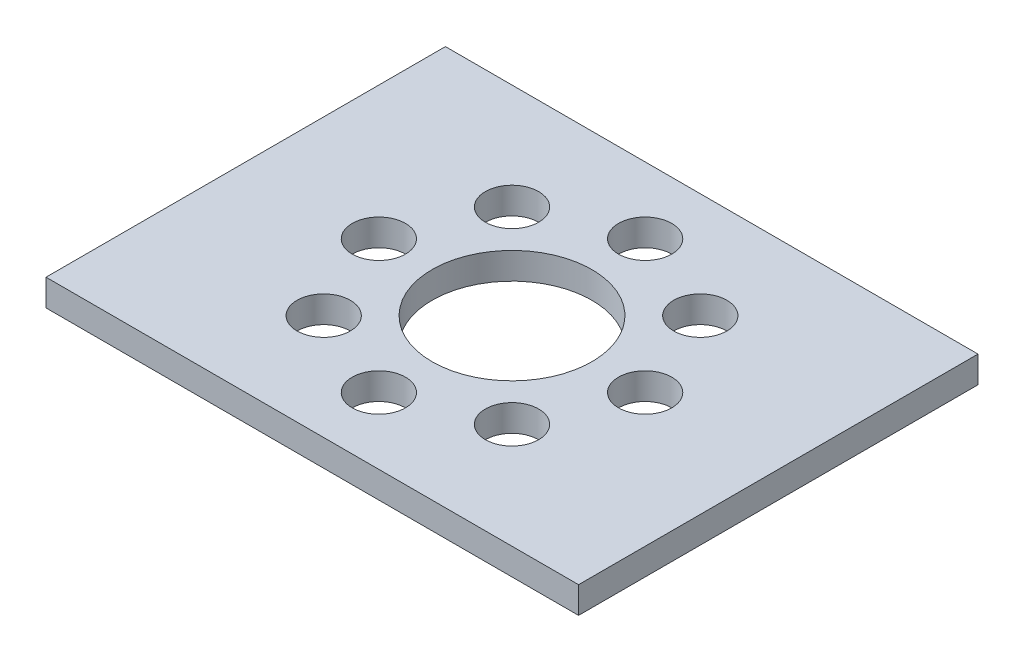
from build123d import *

# Parameters (mm, degrees)
SKETCH1_W           = 200
SKETCH1_H           = 150
SKETCH1_R           = 30
BOSS_EXTRUDE1_DEPTH = 10
SKETCH2_R           = 10
CUT_EXTRUDE1_DEPTH  = 10


with BuildPart() as part:
    # Sketch1 → Boss-Extrude1 (new body)
    with BuildSketch(Plane(origin=(0, 0, 0), x_dir=(1, 0, 0), z_dir=(0, 1, 0))):
        Rectangle(SKETCH1_W, SKETCH1_H)
        with Locations(Location((0, 0, 0), (0, 0, 270))):
            Circle(SKETCH1_R, mode=Mode.SUBTRACT)
    extrude(amount=BOSS_EXTRUDE1_DEPTH)

    # Sketch2 → Cut-Extrude1 (cut)
    with BuildSketch(Plane(origin=(0, 10, 0), x_dir=(1, 0, 0), z_dir=(0, 1, 0))):
        with Locations(Location((0, 50, 0), (0, 0, 270))):
            Circle(SKETCH2_R)
        with Locations(Location((35.355339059, 35.355339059, 0), (0, 0, 270))):
            Circle(SKETCH2_R)
        with Locations(Location((50, 0, 0), (0, 0, 270))):
            Circle(SKETCH2_R)
        with Locations(Location((35.355339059, -35.355339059, 0), (0, 0, 270))):
            Circle(SKETCH2_R)
        with Locations(Location((0, -50, 0), (0, 0, 270))):
            Circle(SKETCH2_R)
        with Locations(Location((-35.355339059, -35.355339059, 0), (0, 0, 270))):
            Circle(SKETCH2_R)
        with Locations(Location((-50, 0, 0), (0, 0, 270))):
            Circle(SKETCH2_R)
        with Locations(Location((-35.355339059, 35.355339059, 0), (0, 0, 270))):
            Circle(SKETCH2_R)
    extrude(amount=-CUT_EXTRUDE1_DEPTH, mode=Mode.SUBTRACT)


solid = part.part
